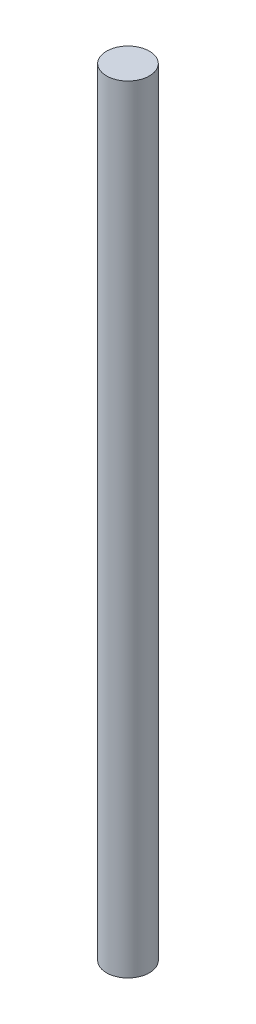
from build123d import *

# Parameters (mm, degrees)
SKETCH1_R           = 4.826
BOSS_EXTRUDE1_DEPTH = 174.752


with BuildPart() as part:
    # Sketch1 → Boss-Extrude1 (new body)
    with BuildSketch(Plane(origin=(0, 0, 0), x_dir=(1, 0, 0), z_dir=(0, 1, 0))):
        with Locations(Location((0, 0, 0), (0, 0, 270))):
            Circle(SKETCH1_R)
    extrude(amount=BOSS_EXTRUDE1_DEPTH)


solid = part.part
